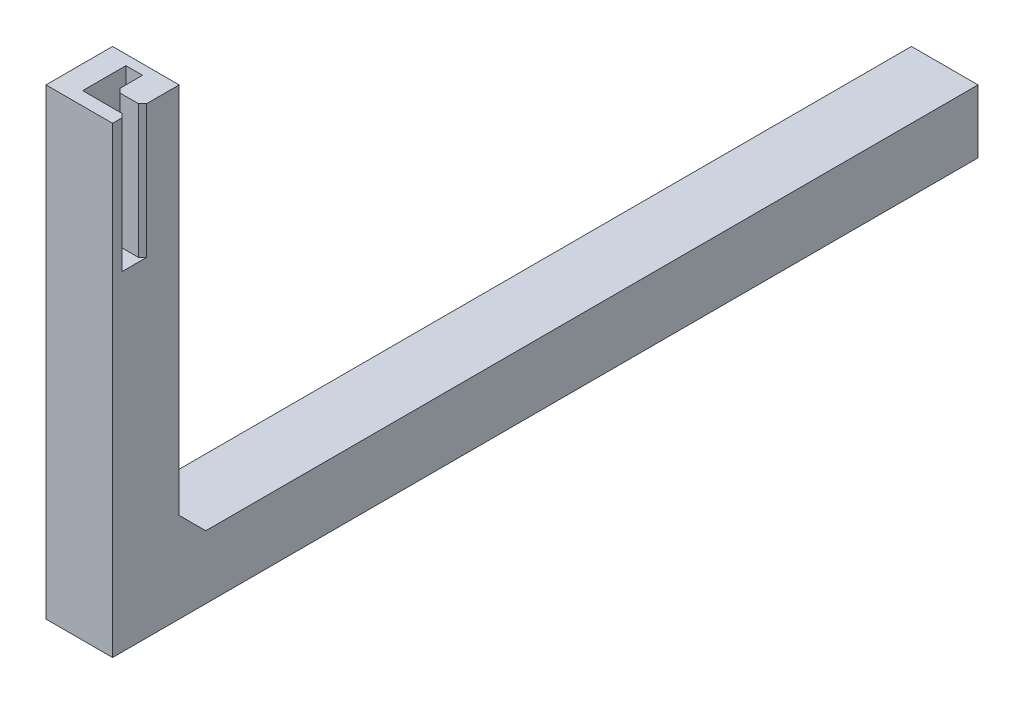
from build123d import *

# Parameters (mm, degrees)
BOSS_EXTRU_1_DEPTH      = 10
CHANFREIN1_SIZE         = 4
CHANFREIN3_SIZE         = 0.5
ENL_V_MAT_EXTRU_1_DEPTH = 20
CHANFREIN4_SIZE         = 0.6


with BuildPart() as part:
    # Esquisse1 → Boss.-Extru.1 (new body)
    with BuildSketch(Plane(origin=(0, 0, 0), x_dir=(0, 0, -1), z_dir=(1, 0, 0))):
        Polygon((0, 0), (0, 70), (10, 70), (10, 10), (130, 10), (130, 0), align=None)
    extrude(amount=-BOSS_EXTRU_1_DEPTH)

    # Chanfrein1
    chanfrein1_edges = [part.edges().sort_by_distance(p)[0] for p in [
        (-5, 10, -10),
    ]]
    chamfer(chanfrein1_edges, length=CHANFREIN1_SIZE)

    # Chanfrein3
    chanfrein3_edges = [part.edges().sort_by_distance(p)[0] for p in [
        (-5, 0, 0),
        (-5, 0, -130),
        (-10, 0, -65),
        (0, 0, -65),
    ]]
    chamfer(chanfrein3_edges, length=CHANFREIN3_SIZE)

    # Esquisse2 → Enl_v. mat.-Extru.1 (cut)
    with BuildSketch(Plane(origin=(0, 70, 0), x_dir=(1, 0, 0), z_dir=(0, 1, 0))):
        Polygon((0, 2), (-6.5, 2), (-6.5, 8.5), (-4, 8.5), (-4, 4.5), (0, 4.5), align=None)
    extrude(amount=-ENL_V_MAT_EXTRU_1_DEPTH, mode=Mode.SUBTRACT)

    # Chanfrein4
    chanfrein4_edges = [part.edges().sort_by_distance(p)[0] for p in [
        (0, 60, -4.5),
        (0, 60, -2),
        (-4, 60, -4.5),
    ]]
    chamfer(chanfrein4_edges, length=CHANFREIN4_SIZE)


solid = part.part
